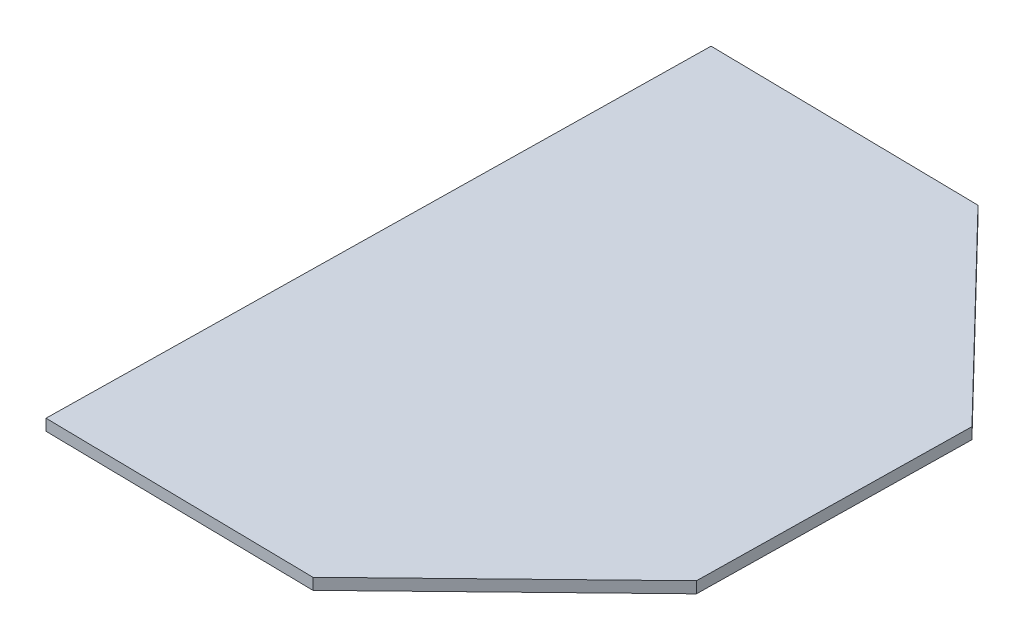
ISO-10303-21;
HEADER;
FILE_DESCRIPTION(('STEP AP214'),'2;1');
FILE_NAME('part.step','',(''),(''),'','','');
FILE_SCHEMA(('AUTOMOTIVE_DESIGN { 1 0 10303 214 1 1 1 1 }'));
ENDSEC;
DATA;
#1=APPLICATION_CONTEXT('core data for automotive mechanical design processes');
#2=APPLICATION_PROTOCOL_DEFINITION('international standard','automotive_design',2000,#1);
#3=PRODUCT_CONTEXT('',#1,'mechanical');
#4=PRODUCT('Part','Part','',(#3));
#5=PRODUCT_RELATED_PRODUCT_CATEGORY('part','',(#4));
#6=PRODUCT_DEFINITION_FORMATION('','',#4);
#7=PRODUCT_DEFINITION_CONTEXT('part definition',#1,'design');
#8=PRODUCT_DEFINITION('design','',#6,#7);
#9=PRODUCT_DEFINITION_SHAPE('','',#8);
#10=(LENGTH_UNIT() NAMED_UNIT(*) SI_UNIT(.MILLI.,.METRE.));
#11=(NAMED_UNIT(*) PLANE_ANGLE_UNIT() SI_UNIT($,.RADIAN.));
#12=(NAMED_UNIT(*) SI_UNIT($,.STERADIAN.) SOLID_ANGLE_UNIT());
#13=UNCERTAINTY_MEASURE_WITH_UNIT(LENGTH_MEASURE(1.E-05),#10,'distance_accuracy_value','');
#14=(GEOMETRIC_REPRESENTATION_CONTEXT(3) GLOBAL_UNCERTAINTY_ASSIGNED_CONTEXT((#13)) GLOBAL_UNIT_ASSIGNED_CONTEXT((#10,
#11,#12)) REPRESENTATION_CONTEXT('',''));
#15=CARTESIAN_POINT('',(0.,0.,0.));
#16=DIRECTION('',(0.,0.,1.));
#17=DIRECTION('',(1.,0.,0.));
#18=AXIS2_PLACEMENT_3D('',#15,#16,#17);
#19=CARTESIAN_POINT('',(348.677479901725,12.,-138.018169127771));
#20=DIRECTION('',(-0.718183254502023,0.,0.695854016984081));
#21=DIRECTION('',(0.695854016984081,0.,0.718183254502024));
#22=AXIS2_PLACEMENT_3D('',#19,#20,#21);
#23=PLANE('',#22);
#24=DIRECTION('',(-0.695854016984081,0.,-0.718183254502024));
#25=VECTOR('',#24,1.);
#26=CARTESIAN_POINT('',(348.677479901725,0.,-138.018169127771));
#27=LINE('',#26,#25);
#28=CARTESIAN_POINT('',(348.677479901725,0.,-138.018169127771));
#29=VERTEX_POINT('',#28);
#30=CARTESIAN_POINT('',(148.958627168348,0.,-344.145793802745));
#31=VERTEX_POINT('',#30);
#32=EDGE_CURVE('E117',#29,#31,#27,.T.);
#33=ORIENTED_EDGE('',*,*,#32,.T.);
#34=DIRECTION('',(0.,-1.,0.));
#35=VECTOR('',#34,1.);
#36=CARTESIAN_POINT('',(148.958627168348,12.,-344.145793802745));
#37=LINE('',#36,#35);
#38=CARTESIAN_POINT('',(148.958627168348,12.,-344.145793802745));
#39=VERTEX_POINT('',#38);
#40=EDGE_CURVE('E11',#39,#31,#37,.T.);
#41=ORIENTED_EDGE('',*,*,#40,.F.);
#42=DIRECTION('',(-0.695854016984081,0.,-0.718183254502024));
#43=VECTOR('',#42,1.);
#44=CARTESIAN_POINT('',(348.677479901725,12.,-138.018169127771));
#45=LINE('',#44,#43);
#46=CARTESIAN_POINT('',(348.677479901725,12.,-138.018169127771));
#47=VERTEX_POINT('',#46);
#48=EDGE_CURVE('E127',#47,#39,#45,.T.);
#49=ORIENTED_EDGE('',*,*,#48,.F.);
#50=DIRECTION('',(0.,-1.,0.));
#51=VECTOR('',#50,1.);
#52=CARTESIAN_POINT('',(348.677479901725,12.,-138.018169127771));
#53=LINE('',#52,#51);
#54=EDGE_CURVE('E113',#47,#29,#53,.T.);
#55=ORIENTED_EDGE('',*,*,#54,.T.);
#56=EDGE_LOOP('',(#33,#41,#49,#55));
#57=FACE_BOUND('',#56,.T.);
#58=ADVANCED_FACE('F33',(#57),#23,.F.);
#59=CARTESIAN_POINT('',(148.958627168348,12.,-344.145793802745));
#60=DIRECTION('',(-0.015789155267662,0.,0.999875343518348));
#61=DIRECTION('',(0.999875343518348,0.,0.015789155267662));
#62=AXIS2_PLACEMENT_3D('',#59,#60,#61);
#63=PLANE('',#62);
#64=DIRECTION('',(-0.999875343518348,0.,-0.015789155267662));
#65=VECTOR('',#64,1.);
#66=CARTESIAN_POINT('',(148.958627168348,0.,-344.145793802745));
#67=LINE('',#66,#65);
#68=CARTESIAN_POINT('',(-138.018169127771,0.,-348.677479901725));
#69=VERTEX_POINT('',#68);
#70=EDGE_CURVE('E120',#31,#69,#67,.T.);
#71=ORIENTED_EDGE('',*,*,#70,.T.);
#72=DIRECTION('',(0.,-1.,0.));
#73=VECTOR('',#72,1.);
#74=CARTESIAN_POINT('',(-138.018169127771,12.,-348.677479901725));
#75=LINE('',#74,#73);
#76=CARTESIAN_POINT('',(-138.018169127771,12.,-348.677479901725));
#77=VERTEX_POINT('',#76);
#78=EDGE_CURVE('E41',#77,#69,#75,.T.);
#79=ORIENTED_EDGE('',*,*,#78,.F.);
#80=DIRECTION('',(-0.999875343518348,0.,-0.015789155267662));
#81=VECTOR('',#80,1.);
#82=CARTESIAN_POINT('',(148.958627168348,12.,-344.145793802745));
#83=LINE('',#82,#81);
#84=EDGE_CURVE('E86',#39,#77,#83,.T.);
#85=ORIENTED_EDGE('',*,*,#84,.F.);
#86=ORIENTED_EDGE('',*,*,#40,.T.);
#87=EDGE_LOOP('',(#71,#79,#85,#86));
#88=FACE_BOUND('',#87,.T.);
#89=ADVANCED_FACE('F151',(#88),#63,.F.);
#90=CARTESIAN_POINT('',(-138.018169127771,12.,-348.677479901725));
#91=DIRECTION('',(0.999875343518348,0.,0.0157891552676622));
#92=DIRECTION('',(0.0157891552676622,0.,-0.999875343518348));
#93=AXIS2_PLACEMENT_3D('',#90,#91,#92);
#94=PLANE('',#93);
#95=DIRECTION('',(-0.0157891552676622,0.,0.999875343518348));
#96=VECTOR('',#95,1.);
#97=CARTESIAN_POINT('',(-138.018169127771,0.,-348.677479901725));
#98=LINE('',#97,#96);
#99=CARTESIAN_POINT('',(-148.958627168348,0.,344.145793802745));
#100=VERTEX_POINT('',#99);
#101=EDGE_CURVE('E122',#69,#100,#98,.T.);
#102=ORIENTED_EDGE('',*,*,#101,.T.);
#103=DIRECTION('',(0.,-1.,0.));
#104=VECTOR('',#103,1.);
#105=CARTESIAN_POINT('',(-148.958627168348,12.,344.145793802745));
#106=LINE('',#105,#104);
#107=CARTESIAN_POINT('',(-148.958627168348,12.,344.145793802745));
#108=VERTEX_POINT('',#107);
#109=EDGE_CURVE('E108',#108,#100,#106,.T.);
#110=ORIENTED_EDGE('',*,*,#109,.F.);
#111=DIRECTION('',(-0.0157891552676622,0.,0.999875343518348));
#112=VECTOR('',#111,1.);
#113=CARTESIAN_POINT('',(-138.018169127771,12.,-348.677479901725));
#114=LINE('',#113,#112);
#115=EDGE_CURVE('E99',#77,#108,#114,.T.);
#116=ORIENTED_EDGE('',*,*,#115,.F.);
#117=ORIENTED_EDGE('',*,*,#78,.T.);
#118=EDGE_LOOP('',(#102,#110,#116,#117));
#119=FACE_BOUND('',#118,.T.);
#120=ADVANCED_FACE('F133',(#119),#94,.F.);
#121=CARTESIAN_POINT('',(-148.958627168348,12.,344.145793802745));
#122=DIRECTION('',(0.0157891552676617,0.,-0.999875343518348));
#123=DIRECTION('',(-0.999875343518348,0.,-0.0157891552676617));
#124=AXIS2_PLACEMENT_3D('',#121,#122,#123);
#125=PLANE('',#124);
#126=DIRECTION('',(0.999875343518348,0.,0.0157891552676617));
#127=VECTOR('',#126,1.);
#128=CARTESIAN_POINT('',(-148.958627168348,0.,344.145793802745));
#129=LINE('',#128,#127);
#130=CARTESIAN_POINT('',(138.018169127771,0.,348.677479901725));
#131=VERTEX_POINT('',#130);
#132=EDGE_CURVE('E107',#100,#131,#129,.T.);
#133=ORIENTED_EDGE('',*,*,#132,.T.);
#134=DIRECTION('',(0.,-1.,0.));
#135=VECTOR('',#134,1.);
#136=CARTESIAN_POINT('',(138.018169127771,12.,348.677479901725));
#137=LINE('',#136,#135);
#138=CARTESIAN_POINT('',(138.018169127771,12.,348.677479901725));
#139=VERTEX_POINT('',#138);
#140=EDGE_CURVE('E104',#139,#131,#137,.T.);
#141=ORIENTED_EDGE('',*,*,#140,.F.);
#142=DIRECTION('',(0.999875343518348,0.,0.0157891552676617));
#143=VECTOR('',#142,1.);
#144=CARTESIAN_POINT('',(-148.958627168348,12.,344.145793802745));
#145=LINE('',#144,#143);
#146=EDGE_CURVE('E93',#108,#139,#145,.T.);
#147=ORIENTED_EDGE('',*,*,#146,.F.);
#148=ORIENTED_EDGE('',*,*,#109,.T.);
#149=EDGE_LOOP('',(#133,#141,#147,#148));
#150=FACE_BOUND('',#149,.T.);
#151=ADVANCED_FACE('F105',(#150),#125,.F.);
#152=CARTESIAN_POINT('',(138.018169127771,12.,348.677479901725));
#153=DIRECTION('',(-0.695854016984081,0.,-0.718183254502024));
#154=DIRECTION('',(-0.718183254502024,0.,0.695854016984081));
#155=AXIS2_PLACEMENT_3D('',#152,#153,#154);
#156=PLANE('',#155);
#157=DIRECTION('',(0.718183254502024,0.,-0.695854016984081));
#158=VECTOR('',#157,1.);
#159=CARTESIAN_POINT('',(138.018169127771,0.,348.677479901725));
#160=LINE('',#159,#158);
#161=CARTESIAN_POINT('',(344.145793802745,0.,148.958627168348));
#162=VERTEX_POINT('',#161);
#163=EDGE_CURVE('E72',#131,#162,#160,.T.);
#164=ORIENTED_EDGE('',*,*,#163,.T.);
#165=DIRECTION('',(0.,-1.,0.));
#166=VECTOR('',#165,1.);
#167=CARTESIAN_POINT('',(344.145793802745,12.,148.958627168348));
#168=LINE('',#167,#166);
#169=CARTESIAN_POINT('',(344.145793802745,12.,148.958627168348));
#170=VERTEX_POINT('',#169);
#171=EDGE_CURVE('E109',#170,#162,#168,.T.);
#172=ORIENTED_EDGE('',*,*,#171,.F.);
#173=DIRECTION('',(0.718183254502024,0.,-0.695854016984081));
#174=VECTOR('',#173,1.);
#175=CARTESIAN_POINT('',(138.018169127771,12.,348.677479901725));
#176=LINE('',#175,#174);
#177=EDGE_CURVE('E97',#139,#170,#176,.T.);
#178=ORIENTED_EDGE('',*,*,#177,.F.);
#179=ORIENTED_EDGE('',*,*,#140,.T.);
#180=EDGE_LOOP('',(#164,#172,#178,#179));
#181=FACE_BOUND('',#180,.T.);
#182=ADVANCED_FACE('F111',(#181),#156,.F.);
#183=CARTESIAN_POINT('',(344.145793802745,12.,148.958627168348));
#184=DIRECTION('',(-0.999875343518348,0.,-0.0157891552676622));
#185=DIRECTION('',(-0.0157891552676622,0.,0.999875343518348));
#186=AXIS2_PLACEMENT_3D('',#183,#184,#185);
#187=PLANE('',#186);
#188=DIRECTION('',(0.0157891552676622,0.,-0.999875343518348));
#189=VECTOR('',#188,1.);
#190=CARTESIAN_POINT('',(344.145793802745,0.,148.958627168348));
#191=LINE('',#190,#189);
#192=EDGE_CURVE('E78',#162,#29,#191,.T.);
#193=ORIENTED_EDGE('',*,*,#192,.T.);
#194=ORIENTED_EDGE('',*,*,#54,.F.);
#195=DIRECTION('',(0.0157891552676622,0.,-0.999875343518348));
#196=VECTOR('',#195,1.);
#197=CARTESIAN_POINT('',(344.145793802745,12.,148.958627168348));
#198=LINE('',#197,#196);
#199=EDGE_CURVE('E49',#170,#47,#198,.T.);
#200=ORIENTED_EDGE('',*,*,#199,.F.);
#201=ORIENTED_EDGE('',*,*,#171,.T.);
#202=EDGE_LOOP('',(#193,#194,#200,#201));
#203=FACE_BOUND('',#202,.T.);
#204=ADVANCED_FACE('F140',(#203),#187,.F.);
#205=CARTESIAN_POINT('',(0.,12.,0.));
#206=DIRECTION('',(0.,-1.,0.));
#207=DIRECTION('',(0.,0.,-1.));
#208=AXIS2_PLACEMENT_3D('',#205,#206,#207);
#209=PLANE('',#208);
#210=ORIENTED_EDGE('',*,*,#48,.T.);
#211=ORIENTED_EDGE('',*,*,#84,.T.);
#212=ORIENTED_EDGE('',*,*,#115,.T.);
#213=ORIENTED_EDGE('',*,*,#146,.T.);
#214=ORIENTED_EDGE('',*,*,#177,.T.);
#215=ORIENTED_EDGE('',*,*,#199,.T.);
#216=EDGE_LOOP('',(#210,#211,#212,#213,#214,#215));
#217=FACE_BOUND('',#216,.T.);
#218=ADVANCED_FACE('F95',(#217),#209,.F.);
#219=CARTESIAN_POINT('',(0.,0.,0.));
#220=DIRECTION('',(0.,-1.,0.));
#221=DIRECTION('',(0.,0.,-1.));
#222=AXIS2_PLACEMENT_3D('',#219,#220,#221);
#223=PLANE('',#222);
#224=ORIENTED_EDGE('',*,*,#32,.F.);
#225=ORIENTED_EDGE('',*,*,#192,.F.);
#226=ORIENTED_EDGE('',*,*,#163,.F.);
#227=ORIENTED_EDGE('',*,*,#132,.F.);
#228=ORIENTED_EDGE('',*,*,#101,.F.);
#229=ORIENTED_EDGE('',*,*,#70,.F.);
#230=EDGE_LOOP('',(#224,#225,#226,#227,#228,#229));
#231=FACE_BOUND('',#230,.T.);
#232=ADVANCED_FACE('F136',(#231),#223,.T.);
#233=CLOSED_SHELL('',(#58,#89,#120,#151,#182,#204,#218,#232));
#234=MANIFOLD_SOLID_BREP('B2',#233);
#235=ADVANCED_BREP_SHAPE_REPRESENTATION('',(#18,#234),#14);
#236=SHAPE_DEFINITION_REPRESENTATION(#9,#235);
ENDSEC;
END-ISO-10303-21;
